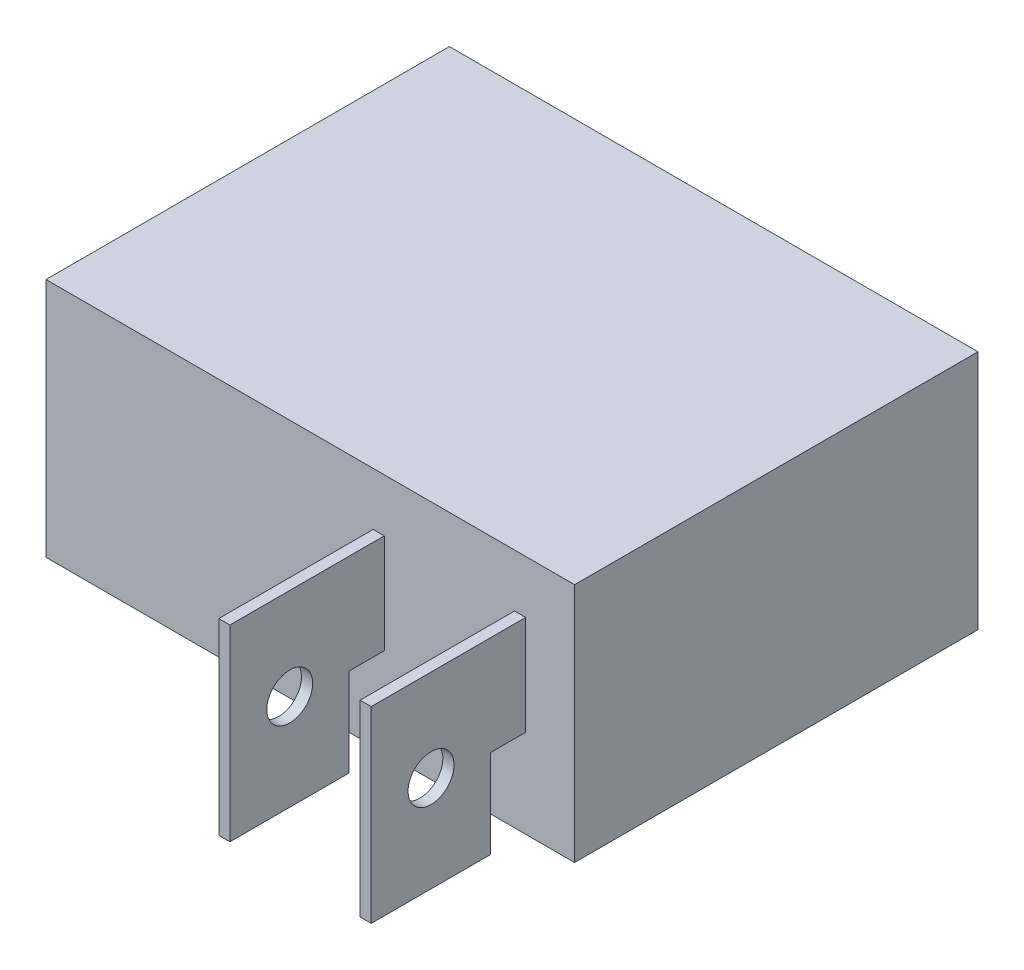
from build123d import *

# Parameters (mm, degrees)
SKETCH1_W           = 38
SKETCH1_H           = 29
BOSS_EXTRUDE1_DEPTH = 17.3
SKETCH2_R           = 1.65
BOSS_EXTRUDE2_DEPTH = 0.4
LPATTERN1_COUNT     = 2
LPATTERN1_PITCH     = 10.16


with BuildPart() as part:
    # Sketch1 → Boss-Extrude1 (new body)
    with BuildSketch(Plane(origin=(0, 0, 0), x_dir=(1, 0, 0), z_dir=(0, 1, 0))):
        Rectangle(SKETCH1_W, SKETCH1_H)
    extrude(amount=BOSS_EXTRUDE1_DEPTH)

    # Sketch2 → Boss-Extrude2 (add, symmetric)
    with BuildSketch(Plane.ZY.offset(-4.919999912)):
        Polygon((14.5, 13.5), (25.6, 13.5), (25.6, 0), (17.03, 0), (17.03, 6.35), (14.5, 6.35), align=None)
        with Locations((21.3, 6.9)):
            Circle(SKETCH2_R, mode=Mode.SUBTRACT)
    boss_extrude2 = extrude(amount=BOSS_EXTRUDE2_DEPTH, both=True)

    # LPattern1: Boss-Extrude2 ×2
    with Locations(*[(i * LPATTERN1_PITCH, 0, 0) for i in range(1, LPATTERN1_COUNT)]):
        add(boss_extrude2)


solid = part.part
